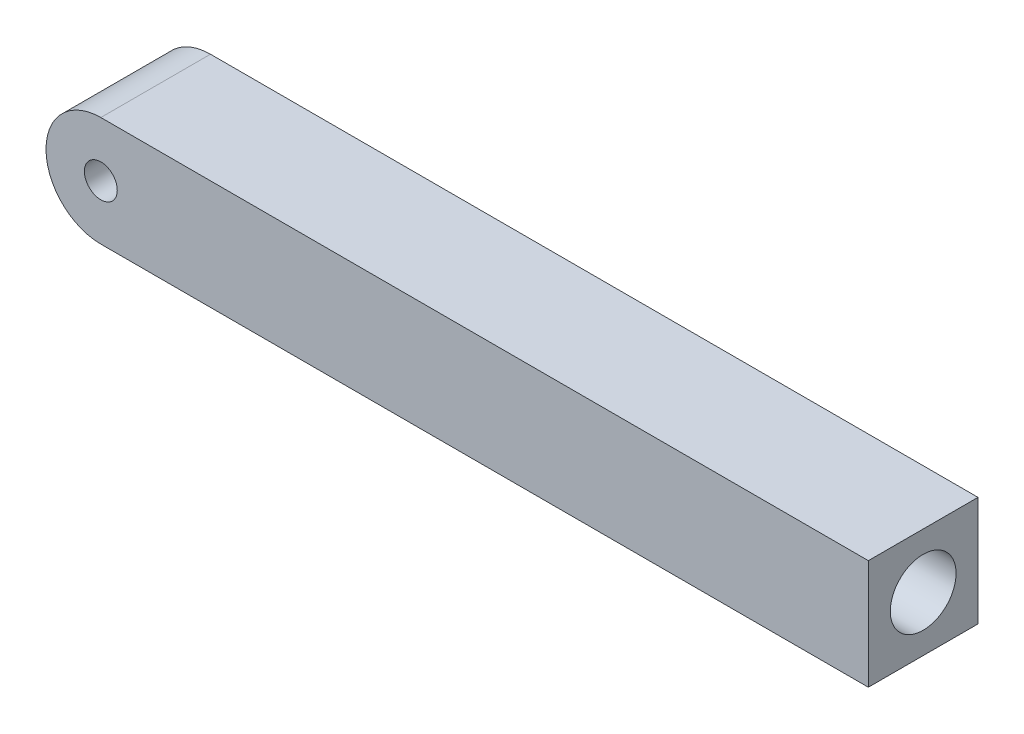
from build123d import *

# Parameters (mm, degrees)
ESQUISSE1_R             = 0.75
BASE_EXTRUSION_DEPTH    = 5
ESQUISSE2_R             = 1.5
ENL_V_MAT_EXTRU_1_DEPTH = 20


with BuildPart() as part:
    # Esquisse1 → Base-Extrusion (new body)
    with BuildSketch(Plane.XY):
        with BuildLine():
            Line((0, 2.5), (35, 2.5))
            Line((35, 2.5), (35, -2.5))
            Line((35, -2.5), (0, -2.5))
            ThreePointArc((0, -2.5), (-2.5, 0), (0, 2.5))
        make_face()
        Circle(ESQUISSE1_R, mode=Mode.SUBTRACT)
    extrude(amount=BASE_EXTRUSION_DEPTH)

    # Esquisse2 → Enl_v. mat.-Extru.1 (cut)
    with BuildSketch(Plane(origin=(35, 0, 0), x_dir=(0, 0, -1), z_dir=(1, 0, 0))):
        with Locations(Location((-2.5, 0, 0), (0, 0, 90))):
            Circle(ESQUISSE2_R)
    extrude(amount=-ENL_V_MAT_EXTRU_1_DEPTH, mode=Mode.SUBTRACT)


solid = part.part
